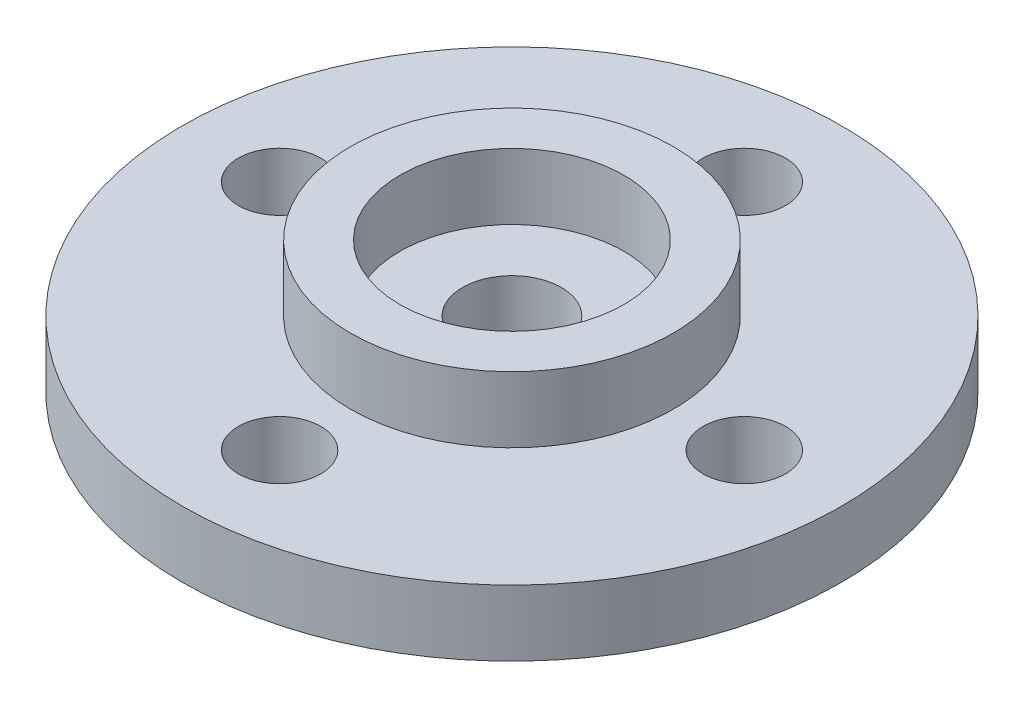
ISO-10303-21;
HEADER;
FILE_DESCRIPTION(('STEP AP214'),'2;1');
FILE_NAME('part.step','',(''),(''),'','','');
FILE_SCHEMA(('AUTOMOTIVE_DESIGN { 1 0 10303 214 1 1 1 1 }'));
ENDSEC;
DATA;
#1=APPLICATION_CONTEXT('core data for automotive mechanical design processes');
#2=APPLICATION_PROTOCOL_DEFINITION('international standard','automotive_design',2000,#1);
#3=PRODUCT_CONTEXT('',#1,'mechanical');
#4=PRODUCT('Part','Part','',(#3));
#5=PRODUCT_RELATED_PRODUCT_CATEGORY('part','',(#4));
#6=PRODUCT_DEFINITION_FORMATION('','',#4);
#7=PRODUCT_DEFINITION_CONTEXT('part definition',#1,'design');
#8=PRODUCT_DEFINITION('design','',#6,#7);
#9=PRODUCT_DEFINITION_SHAPE('','',#8);
#10=(LENGTH_UNIT() NAMED_UNIT(*) SI_UNIT(.MILLI.,.METRE.));
#11=(NAMED_UNIT(*) PLANE_ANGLE_UNIT() SI_UNIT($,.RADIAN.));
#12=(NAMED_UNIT(*) SI_UNIT($,.STERADIAN.) SOLID_ANGLE_UNIT());
#13=UNCERTAINTY_MEASURE_WITH_UNIT(LENGTH_MEASURE(1.E-05),#10,'distance_accuracy_value','');
#14=(GEOMETRIC_REPRESENTATION_CONTEXT(3) GLOBAL_UNCERTAINTY_ASSIGNED_CONTEXT((#13)) GLOBAL_UNIT_ASSIGNED_CONTEXT((#10,
#11,#12)) REPRESENTATION_CONTEXT('',''));
#15=CARTESIAN_POINT('',(0.,0.,0.));
#16=DIRECTION('',(0.,0.,1.));
#17=DIRECTION('',(1.,0.,0.));
#18=AXIS2_PLACEMENT_3D('',#15,#16,#17);
#19=CARTESIAN_POINT('',(0.,2.,0.));
#20=DIRECTION('',(0.,-1.,0.));
#21=DIRECTION('',(0.,0.,-1.));
#22=AXIS2_PLACEMENT_3D('',#19,#20,#21);
#23=CYLINDRICAL_SURFACE('',#22,10.);
#24=CARTESIAN_POINT('',(0.,2.,0.));
#25=DIRECTION('',(0.,1.,0.));
#26=DIRECTION('',(0.,0.,1.));
#27=AXIS2_PLACEMENT_3D('',#24,#25,#26);
#28=CIRCLE('',#27,10.);
#29=CARTESIAN_POINT('',(0.,2.,10.));
#30=VERTEX_POINT('',#29);
#31=EDGE_CURVE('E39',#30,#30,#28,.T.);
#32=ORIENTED_EDGE('',*,*,#31,.F.);
#33=EDGE_LOOP('',(#32));
#34=FACE_BOUND('',#33,.T.);
#35=CARTESIAN_POINT('',(0.,0.,0.));
#36=DIRECTION('',(0.,1.,0.));
#37=DIRECTION('',(0.,0.,1.));
#38=AXIS2_PLACEMENT_3D('',#35,#36,#37);
#39=CIRCLE('',#38,10.);
#40=CARTESIAN_POINT('',(0.,0.,10.));
#41=VERTEX_POINT('',#40);
#42=EDGE_CURVE('E43',#41,#41,#39,.T.);
#43=ORIENTED_EDGE('',*,*,#42,.T.);
#44=EDGE_LOOP('',(#43));
#45=FACE_BOUND('',#44,.T.);
#46=ADVANCED_FACE('F33',(#34,#45),#23,.T.);
#47=CARTESIAN_POINT('',(0.,2.,0.));
#48=DIRECTION('',(0.,1.,0.));
#49=DIRECTION('',(0.,0.,1.));
#50=AXIS2_PLACEMENT_3D('',#47,#48,#49);
#51=PLANE('',#50);
#52=CARTESIAN_POINT('',(7.0500000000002,2.,-1.99509675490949E-13));
#53=DIRECTION('',(0.,1.,0.));
#54=DIRECTION('',(0.,0.,1.));
#55=AXIS2_PLACEMENT_3D('',#52,#53,#54);
#56=CIRCLE('',#55,1.25000000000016);
#57=CARTESIAN_POINT('',(7.0500000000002,2.,1.24999999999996));
#58=VERTEX_POINT('',#57);
#59=EDGE_CURVE('E78',#58,#58,#56,.T.);
#60=ORIENTED_EDGE('',*,*,#59,.F.);
#61=EDGE_LOOP('',(#60));
#62=FACE_BOUND('',#61,.T.);
#63=CARTESIAN_POINT('',(3.99019350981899E-13,2.,7.05));
#64=DIRECTION('',(0.,1.,0.));
#65=DIRECTION('',(0.,0.,1.));
#66=AXIS2_PLACEMENT_3D('',#63,#64,#65);
#67=CIRCLE('',#66,1.25000000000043);
#68=CARTESIAN_POINT('',(3.99019350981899E-13,2.,8.30000000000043));
#69=VERTEX_POINT('',#68);
#70=EDGE_CURVE('E72',#69,#69,#67,.T.);
#71=ORIENTED_EDGE('',*,*,#70,.F.);
#72=EDGE_LOOP('',(#71));
#73=FACE_BOUND('',#72,.T.);
#74=CARTESIAN_POINT('',(-7.0499999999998,2.,2.00373051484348E-13));
#75=DIRECTION('',(0.,1.,0.));
#76=DIRECTION('',(0.,0.,1.));
#77=AXIS2_PLACEMENT_3D('',#74,#75,#76);
#78=CIRCLE('',#77,1.25000000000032);
#79=CARTESIAN_POINT('',(-7.0499999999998,2.,1.25000000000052));
#80=VERTEX_POINT('',#79);
#81=EDGE_CURVE('E65',#80,#80,#78,.T.);
#82=ORIENTED_EDGE('',*,*,#81,.F.);
#83=EDGE_LOOP('',(#82));
#84=FACE_BOUND('',#83,.T.);
#85=CARTESIAN_POINT('',(0.,2.,-7.05));
#86=DIRECTION('',(0.,1.,0.));
#87=DIRECTION('',(0.,0.,1.));
#88=AXIS2_PLACEMENT_3D('',#85,#86,#87);
#89=CIRCLE('',#88,1.25);
#90=CARTESIAN_POINT('',(0.,2.,-5.8));
#91=VERTEX_POINT('',#90);
#92=EDGE_CURVE('E59',#91,#91,#89,.T.);
#93=ORIENTED_EDGE('',*,*,#92,.F.);
#94=EDGE_LOOP('',(#93));
#95=FACE_BOUND('',#94,.T.);
#96=CARTESIAN_POINT('',(0.,2.,0.));
#97=DIRECTION('',(0.,1.,0.));
#98=DIRECTION('',(0.,0.,1.));
#99=AXIS2_PLACEMENT_3D('',#96,#97,#98);
#100=CIRCLE('',#99,4.9);
#101=CARTESIAN_POINT('',(0.,2.,4.9));
#102=VERTEX_POINT('',#101);
#103=EDGE_CURVE('E50',#102,#102,#100,.T.);
#104=ORIENTED_EDGE('',*,*,#103,.F.);
#105=EDGE_LOOP('',(#104));
#106=FACE_BOUND('',#105,.T.);
#107=ORIENTED_EDGE('',*,*,#31,.T.);
#108=EDGE_LOOP('',(#107));
#109=FACE_BOUND('',#108,.T.);
#110=ADVANCED_FACE('F105',(#62,#73,#84,#95,#106,#109),#51,.T.);
#111=CARTESIAN_POINT('',(0.,0.,0.));
#112=DIRECTION('',(0.,1.,0.));
#113=DIRECTION('',(0.,0.,1.));
#114=AXIS2_PLACEMENT_3D('',#111,#112,#113);
#115=PLANE('',#114);
#116=CARTESIAN_POINT('',(0.,0.,0.));
#117=DIRECTION('',(0.,1.,0.));
#118=DIRECTION('',(0.,0.,1.));
#119=AXIS2_PLACEMENT_3D('',#116,#117,#118);
#120=CIRCLE('',#119,1.5);
#121=CARTESIAN_POINT('',(0.,0.,1.5));
#122=VERTEX_POINT('',#121);
#123=EDGE_CURVE('E69',#122,#122,#120,.T.);
#124=ORIENTED_EDGE('',*,*,#123,.T.);
#125=EDGE_LOOP('',(#124));
#126=FACE_BOUND('',#125,.T.);
#127=CARTESIAN_POINT('',(7.0500000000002,0.,-1.99509675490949E-13));
#128=DIRECTION('',(0.,1.,0.));
#129=DIRECTION('',(0.,0.,1.));
#130=AXIS2_PLACEMENT_3D('',#127,#128,#129);
#131=CIRCLE('',#130,1.25000000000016);
#132=CARTESIAN_POINT('',(7.0500000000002,0.,1.24999999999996));
#133=VERTEX_POINT('',#132);
#134=EDGE_CURVE('E62',#133,#133,#131,.T.);
#135=ORIENTED_EDGE('',*,*,#134,.T.);
#136=EDGE_LOOP('',(#135));
#137=FACE_BOUND('',#136,.T.);
#138=CARTESIAN_POINT('',(3.99019350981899E-13,0.,7.05));
#139=DIRECTION('',(0.,1.,0.));
#140=DIRECTION('',(0.,0.,1.));
#141=AXIS2_PLACEMENT_3D('',#138,#139,#140);
#142=CIRCLE('',#141,1.25000000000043);
#143=CARTESIAN_POINT('',(3.99019350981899E-13,0.,8.30000000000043));
#144=VERTEX_POINT('',#143);
#145=EDGE_CURVE('E75',#144,#144,#142,.T.);
#146=ORIENTED_EDGE('',*,*,#145,.T.);
#147=EDGE_LOOP('',(#146));
#148=FACE_BOUND('',#147,.T.);
#149=CARTESIAN_POINT('',(-7.0499999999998,0.,2.00373051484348E-13));
#150=DIRECTION('',(0.,1.,0.));
#151=DIRECTION('',(0.,0.,1.));
#152=AXIS2_PLACEMENT_3D('',#149,#150,#151);
#153=CIRCLE('',#152,1.25000000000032);
#154=CARTESIAN_POINT('',(-7.0499999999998,0.,1.25000000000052));
#155=VERTEX_POINT('',#154);
#156=EDGE_CURVE('E68',#155,#155,#153,.T.);
#157=ORIENTED_EDGE('',*,*,#156,.T.);
#158=EDGE_LOOP('',(#157));
#159=FACE_BOUND('',#158,.T.);
#160=CARTESIAN_POINT('',(0.,0.,-7.05));
#161=DIRECTION('',(0.,1.,0.));
#162=DIRECTION('',(0.,0.,1.));
#163=AXIS2_PLACEMENT_3D('',#160,#161,#162);
#164=CIRCLE('',#163,1.25);
#165=CARTESIAN_POINT('',(0.,0.,-5.8));
#166=VERTEX_POINT('',#165);
#167=EDGE_CURVE('E58',#166,#166,#164,.T.);
#168=ORIENTED_EDGE('',*,*,#167,.T.);
#169=EDGE_LOOP('',(#168));
#170=FACE_BOUND('',#169,.T.);
#171=ORIENTED_EDGE('',*,*,#42,.F.);
#172=EDGE_LOOP('',(#171));
#173=FACE_BOUND('',#172,.T.);
#174=ADVANCED_FACE('F89',(#126,#137,#148,#159,#170,#173),#115,.F.);
#175=CARTESIAN_POINT('',(0.,4.,0.));
#176=DIRECTION('',(0.,1.,0.));
#177=DIRECTION('',(0.,0.,1.));
#178=AXIS2_PLACEMENT_3D('',#175,#176,#177);
#179=PLANE('',#178);
#180=CARTESIAN_POINT('',(0.,4.,0.));
#181=DIRECTION('',(0.,1.,0.));
#182=DIRECTION('',(0.,0.,1.));
#183=AXIS2_PLACEMENT_3D('',#180,#181,#182);
#184=CIRCLE('',#183,4.9);
#185=CARTESIAN_POINT('',(0.,4.,4.9));
#186=VERTEX_POINT('',#185);
#187=EDGE_CURVE('E48',#186,#186,#184,.T.);
#188=ORIENTED_EDGE('',*,*,#187,.T.);
#189=EDGE_LOOP('',(#188));
#190=FACE_BOUND('',#189,.T.);
#191=CARTESIAN_POINT('',(0.,4.,0.));
#192=DIRECTION('',(0.,1.,0.));
#193=DIRECTION('',(0.,0.,1.));
#194=AXIS2_PLACEMENT_3D('',#191,#192,#193);
#195=CIRCLE('',#194,3.4);
#196=CARTESIAN_POINT('',(0.,4.,3.4));
#197=VERTEX_POINT('',#196);
#198=EDGE_CURVE('E53',#197,#197,#195,.T.);
#199=ORIENTED_EDGE('',*,*,#198,.F.);
#200=EDGE_LOOP('',(#199));
#201=FACE_BOUND('',#200,.T.);
#202=ADVANCED_FACE('F127',(#190,#201),#179,.T.);
#203=CARTESIAN_POINT('',(0.,4.,0.));
#204=DIRECTION('',(0.,-1.,0.));
#205=DIRECTION('',(0.,0.,-1.));
#206=AXIS2_PLACEMENT_3D('',#203,#204,#205);
#207=CYLINDRICAL_SURFACE('',#206,4.9);
#208=ORIENTED_EDGE('',*,*,#187,.F.);
#209=EDGE_LOOP('',(#208));
#210=FACE_BOUND('',#209,.T.);
#211=ORIENTED_EDGE('',*,*,#103,.T.);
#212=EDGE_LOOP('',(#211));
#213=FACE_BOUND('',#212,.T.);
#214=ADVANCED_FACE('F113',(#210,#213),#207,.T.);
#215=CARTESIAN_POINT('',(0.,4.,0.));
#216=DIRECTION('',(0.,-1.,0.));
#217=DIRECTION('',(0.,0.,-1.));
#218=AXIS2_PLACEMENT_3D('',#215,#216,#217);
#219=CYLINDRICAL_SURFACE('',#218,3.4);
#220=ORIENTED_EDGE('',*,*,#198,.T.);
#221=EDGE_LOOP('',(#220));
#222=FACE_BOUND('',#221,.T.);
#223=CARTESIAN_POINT('',(0.,2.,0.));
#224=DIRECTION('',(0.,1.,0.));
#225=DIRECTION('',(0.,0.,1.));
#226=AXIS2_PLACEMENT_3D('',#223,#224,#225);
#227=CIRCLE('',#226,3.4);
#228=CARTESIAN_POINT('',(0.,2.,3.4));
#229=VERTEX_POINT('',#228);
#230=EDGE_CURVE('E10',#229,#229,#227,.F.);
#231=ORIENTED_EDGE('',*,*,#230,.T.);
#232=EDGE_LOOP('',(#231));
#233=FACE_BOUND('',#232,.T.);
#234=ADVANCED_FACE('F103',(#222,#233),#219,.F.);
#235=CARTESIAN_POINT('',(0.,2.,0.));
#236=DIRECTION('',(0.,1.,0.));
#237=DIRECTION('',(0.,0.,1.));
#238=AXIS2_PLACEMENT_3D('',#235,#236,#237);
#239=CIRCLE('',#238,1.5);
#240=CARTESIAN_POINT('',(0.,2.,1.5));
#241=VERTEX_POINT('',#240);
#242=EDGE_CURVE('E83',#241,#241,#239,.T.);
#243=ORIENTED_EDGE('',*,*,#242,.F.);
#244=EDGE_LOOP('',(#243));
#245=FACE_BOUND('',#244,.T.);
#246=ORIENTED_EDGE('',*,*,#230,.F.);
#247=EDGE_LOOP('',(#246));
#248=FACE_BOUND('',#247,.T.);
#249=ADVANCED_FACE('F99',(#245,#248),#51,.T.);
#250=CARTESIAN_POINT('',(0.,0.,-7.05));
#251=DIRECTION('',(0.,1.,0.));
#252=DIRECTION('',(0.,0.,1.));
#253=AXIS2_PLACEMENT_3D('',#250,#251,#252);
#254=CYLINDRICAL_SURFACE('',#253,1.25);
#255=ORIENTED_EDGE('',*,*,#167,.F.);
#256=EDGE_LOOP('',(#255));
#257=FACE_BOUND('',#256,.T.);
#258=ORIENTED_EDGE('',*,*,#92,.T.);
#259=EDGE_LOOP('',(#258));
#260=FACE_BOUND('',#259,.T.);
#261=ADVANCED_FACE('F102',(#257,#260),#254,.F.);
#262=CARTESIAN_POINT('',(-7.0499999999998,0.,2.00373051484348E-13));
#263=DIRECTION('',(0.,1.,0.));
#264=DIRECTION('',(0.,0.,1.));
#265=AXIS2_PLACEMENT_3D('',#262,#263,#264);
#266=CYLINDRICAL_SURFACE('',#265,1.25000000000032);
#267=ORIENTED_EDGE('',*,*,#156,.F.);
#268=EDGE_LOOP('',(#267));
#269=FACE_BOUND('',#268,.T.);
#270=ORIENTED_EDGE('',*,*,#81,.T.);
#271=EDGE_LOOP('',(#270));
#272=FACE_BOUND('',#271,.T.);
#273=ADVANCED_FACE('F110',(#269,#272),#266,.F.);
#274=CARTESIAN_POINT('',(3.99019350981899E-13,0.,7.05));
#275=DIRECTION('',(0.,1.,0.));
#276=DIRECTION('',(0.,0.,1.));
#277=AXIS2_PLACEMENT_3D('',#274,#275,#276);
#278=CYLINDRICAL_SURFACE('',#277,1.25000000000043);
#279=ORIENTED_EDGE('',*,*,#145,.F.);
#280=EDGE_LOOP('',(#279));
#281=FACE_BOUND('',#280,.T.);
#282=ORIENTED_EDGE('',*,*,#70,.T.);
#283=EDGE_LOOP('',(#282));
#284=FACE_BOUND('',#283,.T.);
#285=ADVANCED_FACE('F141',(#281,#284),#278,.F.);
#286=CARTESIAN_POINT('',(7.0500000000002,0.,-1.99509675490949E-13));
#287=DIRECTION('',(0.,1.,0.));
#288=DIRECTION('',(0.,0.,1.));
#289=AXIS2_PLACEMENT_3D('',#286,#287,#288);
#290=CYLINDRICAL_SURFACE('',#289,1.25000000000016);
#291=ORIENTED_EDGE('',*,*,#134,.F.);
#292=EDGE_LOOP('',(#291));
#293=FACE_BOUND('',#292,.T.);
#294=ORIENTED_EDGE('',*,*,#59,.T.);
#295=EDGE_LOOP('',(#294));
#296=FACE_BOUND('',#295,.T.);
#297=ADVANCED_FACE('F95',(#293,#296),#290,.F.);
#298=CARTESIAN_POINT('',(0.,0.,0.));
#299=DIRECTION('',(0.,1.,0.));
#300=DIRECTION('',(0.,0.,1.));
#301=AXIS2_PLACEMENT_3D('',#298,#299,#300);
#302=CYLINDRICAL_SURFACE('',#301,1.5);
#303=ORIENTED_EDGE('',*,*,#123,.F.);
#304=EDGE_LOOP('',(#303));
#305=FACE_BOUND('',#304,.T.);
#306=ORIENTED_EDGE('',*,*,#242,.T.);
#307=EDGE_LOOP('',(#306));
#308=FACE_BOUND('',#307,.T.);
#309=ADVANCED_FACE('F92',(#305,#308),#302,.F.);
#310=CLOSED_SHELL('',(#46,#110,#174,#202,#214,#234,#249,#261,#273,#285,#297,#309));
#311=MANIFOLD_SOLID_BREP('B2',#310);
#312=ADVANCED_BREP_SHAPE_REPRESENTATION('',(#18,#311),#14);
#313=SHAPE_DEFINITION_REPRESENTATION(#9,#312);
ENDSEC;
END-ISO-10303-21;
